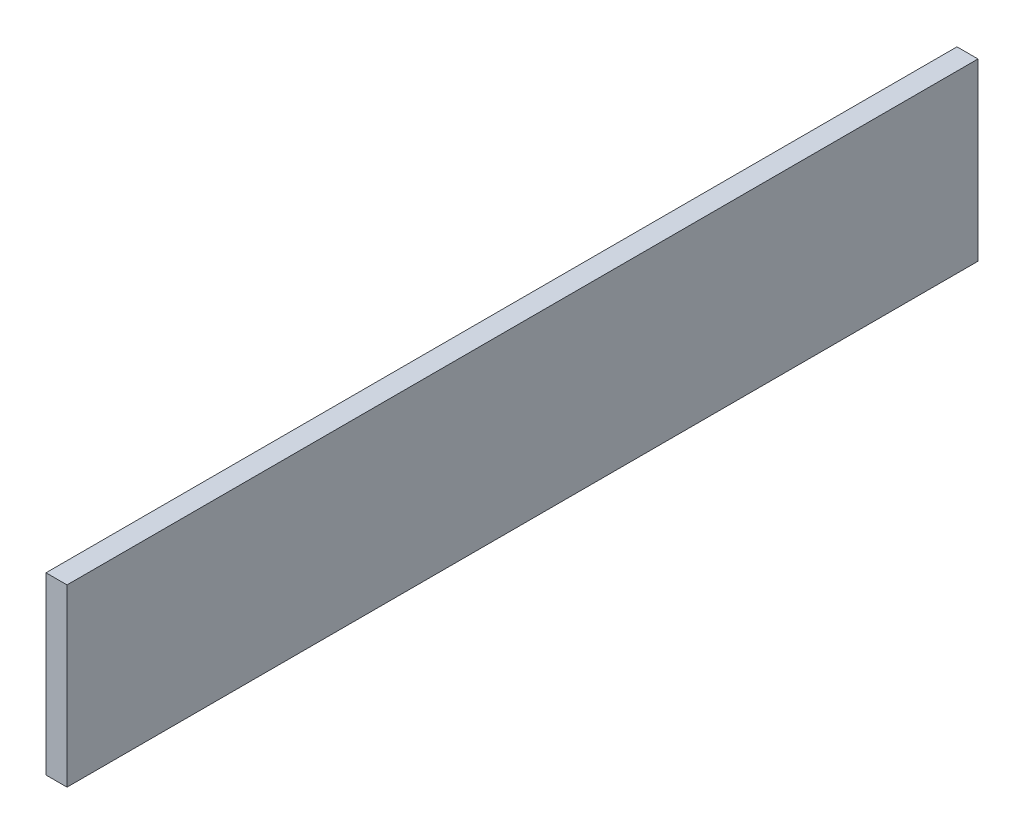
ISO-10303-21;
HEADER;
FILE_DESCRIPTION(('STEP AP214'),'2;1');
FILE_NAME('part.step','',(''),(''),'','','');
FILE_SCHEMA(('AUTOMOTIVE_DESIGN { 1 0 10303 214 1 1 1 1 }'));
ENDSEC;
DATA;
#1=APPLICATION_CONTEXT('core data for automotive mechanical design processes');
#2=APPLICATION_PROTOCOL_DEFINITION('international standard','automotive_design',2000,#1);
#3=PRODUCT_CONTEXT('',#1,'mechanical');
#4=PRODUCT('Part','Part','',(#3));
#5=PRODUCT_RELATED_PRODUCT_CATEGORY('part','',(#4));
#6=PRODUCT_DEFINITION_FORMATION('','',#4);
#7=PRODUCT_DEFINITION_CONTEXT('part definition',#1,'design');
#8=PRODUCT_DEFINITION('design','',#6,#7);
#9=PRODUCT_DEFINITION_SHAPE('','',#8);
#10=(LENGTH_UNIT() NAMED_UNIT(*) SI_UNIT(.MILLI.,.METRE.));
#11=(NAMED_UNIT(*) PLANE_ANGLE_UNIT() SI_UNIT($,.RADIAN.));
#12=(NAMED_UNIT(*) SI_UNIT($,.STERADIAN.) SOLID_ANGLE_UNIT());
#13=UNCERTAINTY_MEASURE_WITH_UNIT(LENGTH_MEASURE(1.E-05),#10,'distance_accuracy_value','');
#14=(GEOMETRIC_REPRESENTATION_CONTEXT(3) GLOBAL_UNCERTAINTY_ASSIGNED_CONTEXT((#13)) GLOBAL_UNIT_ASSIGNED_CONTEXT((#10,
#11,#12)) REPRESENTATION_CONTEXT('',''));
#15=CARTESIAN_POINT('',(0.,0.,0.));
#16=DIRECTION('',(0.,0.,1.));
#17=DIRECTION('',(1.,0.,0.));
#18=AXIS2_PLACEMENT_3D('',#15,#16,#17);
#19=CARTESIAN_POINT('',(1.5,120.,10.));
#20=DIRECTION('',(-1.,0.,0.));
#21=DIRECTION('',(0.,0.,1.));
#22=AXIS2_PLACEMENT_3D('',#19,#20,#21);
#23=PLANE('',#22);
#24=DIRECTION('',(0.,0.,-1.));
#25=VECTOR('',#24,1.);
#26=CARTESIAN_POINT('',(1.5,95.,10.));
#27=LINE('',#26,#25);
#28=CARTESIAN_POINT('',(1.5,95.,10.));
#29=VERTEX_POINT('',#28);
#30=CARTESIAN_POINT('',(1.5,95.,-120.));
#31=VERTEX_POINT('',#30);
#32=EDGE_CURVE('E90',#29,#31,#27,.T.);
#33=ORIENTED_EDGE('',*,*,#32,.T.);
#34=DIRECTION('',(0.,1.,0.));
#35=VECTOR('',#34,1.);
#36=CARTESIAN_POINT('',(1.5,120.,-120.));
#37=LINE('',#36,#35);
#38=CARTESIAN_POINT('',(1.5,120.,-120.));
#39=VERTEX_POINT('',#38);
#40=EDGE_CURVE('E85',#31,#39,#37,.T.);
#41=ORIENTED_EDGE('',*,*,#40,.T.);
#42=DIRECTION('',(0.,0.,-1.));
#43=VECTOR('',#42,1.);
#44=CARTESIAN_POINT('',(1.5,120.,10.));
#45=LINE('',#44,#43);
#46=CARTESIAN_POINT('',(1.5,120.,10.));
#47=VERTEX_POINT('',#46);
#48=EDGE_CURVE('E11',#47,#39,#45,.T.);
#49=ORIENTED_EDGE('',*,*,#48,.F.);
#50=DIRECTION('',(0.,1.,0.));
#51=VECTOR('',#50,1.);
#52=CARTESIAN_POINT('',(1.5,120.,10.));
#53=LINE('',#52,#51);
#54=EDGE_CURVE('E96',#29,#47,#53,.T.);
#55=ORIENTED_EDGE('',*,*,#54,.F.);
#56=EDGE_LOOP('',(#33,#41,#49,#55));
#57=FACE_BOUND('',#56,.T.);
#58=ADVANCED_FACE('F33',(#57),#23,.F.);
#59=CARTESIAN_POINT('',(1.5,120.,10.));
#60=DIRECTION('',(0.,-1.,0.));
#61=DIRECTION('',(0.,0.,-1.));
#62=AXIS2_PLACEMENT_3D('',#59,#60,#61);
#63=PLANE('',#62);
#64=ORIENTED_EDGE('',*,*,#48,.T.);
#65=DIRECTION('',(-1.,0.,0.));
#66=VECTOR('',#65,1.);
#67=CARTESIAN_POINT('',(1.5,120.,-120.));
#68=LINE('',#67,#66);
#69=CARTESIAN_POINT('',(-1.5,120.,-120.));
#70=VERTEX_POINT('',#69);
#71=EDGE_CURVE('E75',#39,#70,#68,.T.);
#72=ORIENTED_EDGE('',*,*,#71,.T.);
#73=DIRECTION('',(0.,0.,-1.));
#74=VECTOR('',#73,1.);
#75=CARTESIAN_POINT('',(-1.5,120.,10.));
#76=LINE('',#75,#74);
#77=CARTESIAN_POINT('',(-1.5,120.,10.));
#78=VERTEX_POINT('',#77);
#79=EDGE_CURVE('E40',#78,#70,#76,.T.);
#80=ORIENTED_EDGE('',*,*,#79,.F.);
#81=DIRECTION('',(-1.,0.,0.));
#82=VECTOR('',#81,1.);
#83=CARTESIAN_POINT('',(1.5,120.,10.));
#84=LINE('',#83,#82);
#85=EDGE_CURVE('E76',#47,#78,#84,.T.);
#86=ORIENTED_EDGE('',*,*,#85,.F.);
#87=EDGE_LOOP('',(#64,#72,#80,#86));
#88=FACE_BOUND('',#87,.T.);
#89=ADVANCED_FACE('F73',(#88),#63,.F.);
#90=CARTESIAN_POINT('',(-1.5,120.,10.));
#91=DIRECTION('',(1.,0.,0.));
#92=DIRECTION('',(0.,0.,-1.));
#93=AXIS2_PLACEMENT_3D('',#90,#91,#92);
#94=PLANE('',#93);
#95=ORIENTED_EDGE('',*,*,#79,.T.);
#96=DIRECTION('',(0.,-1.,0.));
#97=VECTOR('',#96,1.);
#98=CARTESIAN_POINT('',(-1.5,120.,-120.));
#99=LINE('',#98,#97);
#100=CARTESIAN_POINT('',(-1.5,95.,-120.));
#101=VERTEX_POINT('',#100);
#102=EDGE_CURVE('E88',#70,#101,#99,.T.);
#103=ORIENTED_EDGE('',*,*,#102,.T.);
#104=DIRECTION('',(0.,0.,-1.));
#105=VECTOR('',#104,1.);
#106=CARTESIAN_POINT('',(-1.5,95.,10.));
#107=LINE('',#106,#105);
#108=CARTESIAN_POINT('',(-1.5,95.,10.));
#109=VERTEX_POINT('',#108);
#110=EDGE_CURVE('E102',#109,#101,#107,.T.);
#111=ORIENTED_EDGE('',*,*,#110,.F.);
#112=DIRECTION('',(0.,-1.,0.));
#113=VECTOR('',#112,1.);
#114=CARTESIAN_POINT('',(-1.5,120.,10.));
#115=LINE('',#114,#113);
#116=EDGE_CURVE('E52',#78,#109,#115,.T.);
#117=ORIENTED_EDGE('',*,*,#116,.F.);
#118=EDGE_LOOP('',(#95,#103,#111,#117));
#119=FACE_BOUND('',#118,.T.);
#120=ADVANCED_FACE('F104',(#119),#94,.F.);
#121=CARTESIAN_POINT('',(1.5,95.,10.));
#122=DIRECTION('',(0.,1.,0.));
#123=DIRECTION('',(0.,0.,1.));
#124=AXIS2_PLACEMENT_3D('',#121,#122,#123);
#125=PLANE('',#124);
#126=ORIENTED_EDGE('',*,*,#110,.T.);
#127=DIRECTION('',(1.,0.,0.));
#128=VECTOR('',#127,1.);
#129=CARTESIAN_POINT('',(1.5,95.,-120.));
#130=LINE('',#129,#128);
#131=EDGE_CURVE('E94',#101,#31,#130,.T.);
#132=ORIENTED_EDGE('',*,*,#131,.T.);
#133=ORIENTED_EDGE('',*,*,#32,.F.);
#134=DIRECTION('',(1.,0.,0.));
#135=VECTOR('',#134,1.);
#136=CARTESIAN_POINT('',(1.5,95.,10.));
#137=LINE('',#136,#135);
#138=EDGE_CURVE('E47',#109,#29,#137,.T.);
#139=ORIENTED_EDGE('',*,*,#138,.F.);
#140=EDGE_LOOP('',(#126,#132,#133,#139));
#141=FACE_BOUND('',#140,.T.);
#142=ADVANCED_FACE('F106',(#141),#125,.F.);
#143=CARTESIAN_POINT('',(0.,0.,10.));
#144=DIRECTION('',(0.,0.,-1.));
#145=DIRECTION('',(-1.,0.,0.));
#146=AXIS2_PLACEMENT_3D('',#143,#144,#145);
#147=PLANE('',#146);
#148=ORIENTED_EDGE('',*,*,#54,.T.);
#149=ORIENTED_EDGE('',*,*,#85,.T.);
#150=ORIENTED_EDGE('',*,*,#116,.T.);
#151=ORIENTED_EDGE('',*,*,#138,.T.);
#152=EDGE_LOOP('',(#148,#149,#150,#151));
#153=FACE_BOUND('',#152,.T.);
#154=ADVANCED_FACE('F107',(#153),#147,.F.);
#155=CARTESIAN_POINT('',(0.,0.,-120.));
#156=DIRECTION('',(0.,0.,-1.));
#157=DIRECTION('',(-1.,0.,0.));
#158=AXIS2_PLACEMENT_3D('',#155,#156,#157);
#159=PLANE('',#158);
#160=ORIENTED_EDGE('',*,*,#40,.F.);
#161=ORIENTED_EDGE('',*,*,#131,.F.);
#162=ORIENTED_EDGE('',*,*,#102,.F.);
#163=ORIENTED_EDGE('',*,*,#71,.F.);
#164=EDGE_LOOP('',(#160,#161,#162,#163));
#165=FACE_BOUND('',#164,.T.);
#166=ADVANCED_FACE('F83',(#165),#159,.T.);
#167=CLOSED_SHELL('',(#58,#89,#120,#142,#154,#166));
#168=MANIFOLD_SOLID_BREP('B2',#167);
#169=ADVANCED_BREP_SHAPE_REPRESENTATION('',(#18,#168),#14);
#170=SHAPE_DEFINITION_REPRESENTATION(#9,#169);
ENDSEC;
END-ISO-10303-21;
